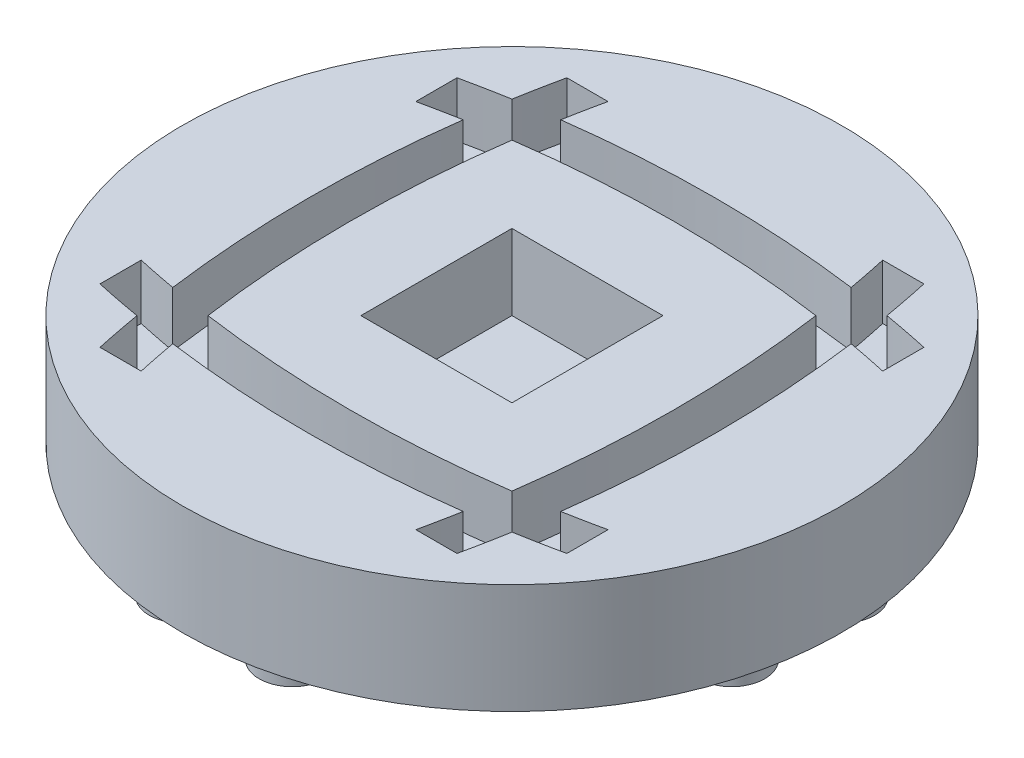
from build123d import *

# Parameters (mm, degrees)
SKETCH1_R           = 24
BOSS_EXTRUDE1_DEPTH = 8
SKETCH3_W           = 11
SKETCH3_H           = 11
CUT_EXTRUDE2_DEPTH  = 5.5
CUT_EXTRUDE6_DEPTH  = 4
SKETCH11_R          = 2.41
BOSS_EXTRUDE2_DEPTH = 1.7


with BuildPart() as part:
    # Sketch1 → Boss-Extrude1 (new body)
    with BuildSketch(Plane(origin=(0, 0, 0), x_dir=(1, 0, 0), z_dir=(0, 1, 0))):
        with Locations(Location((0, 0, 0), (0, 0, 270))):
            Circle(SKETCH1_R)
    extrude(amount=BOSS_EXTRUDE1_DEPTH)

    # Sketch3 → Cut-Extrude2 (cut)
    with BuildSketch(Plane(origin=(0, 8, 0), x_dir=(1, 0, 0), z_dir=(0, 1, 0))):
        Rectangle(SKETCH3_W, SKETCH3_H)
    extrude(amount=-CUT_EXTRUDE2_DEPTH, mode=Mode.SUBTRACT)

    # Sketch10 → Cut-Extrude6 (cut)
    with BuildSketch(Plane(origin=(0, 8, 0), x_dir=(1, 0, 0), z_dir=(0, 1, 0))):
        with BuildLine():
            Line((-17, 13), (-17, 10))
            ThreePointArc((-17, 10), (-15.565150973, 10.301241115), (-14.124974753, 10.575887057))
            ThreePointArc((-14.124974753, 10.575887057), (-14.827114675, 0), (-14.124974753, -10.575887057))
            ThreePointArc((-14.124974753, -10.575887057), (-15.565150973, -10.301241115), (-17, -10))
            Line((-17, -10), (-17, -13))
            ThreePointArc((-17, -13), (-15.330185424, -13.344535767), (-13.653407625, -13.653407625))
            ThreePointArc((-13.653407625, -13.653407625), (-13.344535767, -15.330185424), (-13, -17))
            Line((-13, -17), (-10, -17))
            ThreePointArc((-10, -17), (-10.301241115, -15.565150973), (-10.575887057, -14.124974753))
            ThreePointArc((-10.575887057, -14.124974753), (0, -14.827114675), (10.575887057, -14.124974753))
            ThreePointArc((10.575887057, -14.124974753), (10.301241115, -15.565150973), (10, -17))
            Line((10, -17), (13, -17))
            ThreePointArc((13, -17), (13.344535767, -15.330185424), (13.653407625, -13.653407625))
            ThreePointArc((13.653407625, -13.653407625), (15.330185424, -13.344535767), (17, -13))
            Line((17, -13), (17, -10))
            ThreePointArc((17, -10), (15.565150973, -10.301241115), (14.124974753, -10.575887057))
            ThreePointArc((14.124974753, -10.575887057), (14.827114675, 0), (14.124974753, 10.575887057))
            ThreePointArc((14.124974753, 10.575887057), (15.565150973, 10.301241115), (17, 10))
            Line((17, 10), (17, 13))
            ThreePointArc((17, 13), (15.330185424, 13.344535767), (13.653407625, 13.653407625))
            ThreePointArc((13.653407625, 13.653407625), (13.344535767, 15.330185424), (13, 17))
            Line((13, 17), (10, 17))
            ThreePointArc((10, 17), (10.301241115, 15.565150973), (10.575887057, 14.124974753))
            ThreePointArc((10.575887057, 14.124974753), (0, 14.827114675), (-10.575887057, 14.124974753))
            ThreePointArc((-10.575887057, 14.124974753), (-10.301241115, 15.565150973), (-10, 17))
            Line((-10, 17), (-13, 17))
            ThreePointArc((-13, 17), (-13.344535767, 15.330185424), (-13.653407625, 13.653407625))
            ThreePointArc((-13.653407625, 13.653407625), (-15.330185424, 13.344535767), (-17, 13))
        make_face()
        with BuildLine():
            ThreePointArc((-11.068117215, 11.068117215), (0, 11.844812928), (11.068117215, 11.068117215))
            ThreePointArc((11.068117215, 11.068117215), (11.844812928, 0), (11.068117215, -11.068117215))
            ThreePointArc((11.068117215, -11.068117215), (0, -11.844812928), (-11.068117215, -11.068117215))
            ThreePointArc((-11.068117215, -11.068117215), (-11.844812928, 0), (-11.068117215, 11.068117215))
        make_face(mode=Mode.SUBTRACT)
    extrude(amount=-CUT_EXTRUDE6_DEPTH, mode=Mode.SUBTRACT)

    # Sketch11 → Boss-Extrude2 (add)
    with BuildSketch(Plane.XZ):
        with Locations(Location((-4, -20, 0), (0, 0, 90))):
            Circle(SKETCH11_R)
        with Locations(Location((4, -20, 0), (0, 0, 90))):
            Circle(SKETCH11_R)
        with Locations(Location((-12, -12, 0), (0, 0, 90))):
            Circle(SKETCH11_R)
        with Locations(Location((-4, -12, 0), (0, 0, 90))):
            Circle(SKETCH11_R)
        with Locations(Location((4, -12, 0), (0, 0, 90))):
            Circle(SKETCH11_R)
        with Locations(Location((12, -12, 0), (0, 0, 90))):
            Circle(SKETCH11_R)
        with Locations(Location((-12, -4, 0), (0, 0, 90))):
            Circle(SKETCH11_R)
        with Locations(Location((-4, -4, 0), (0, 0, 90))):
            Circle(SKETCH11_R)
        with Locations(Location((4, -4, 0), (0, 0, 90))):
            Circle(SKETCH11_R)
        with Locations(Location((12, -4, 0), (0, 0, 90))):
            Circle(SKETCH11_R)
        with Locations(Location((20, -4, 0), (0, 0, 90))):
            Circle(SKETCH11_R)
        with Locations(Location((-12, 4, 0), (0, 0, 90))):
            Circle(SKETCH11_R)
        with Locations(Location((-4, 4, 0), (0, 0, 90))):
            Circle(SKETCH11_R)
        with Locations(Location((4, 4, 0), (0, 0, 90))):
            Circle(SKETCH11_R)
        with Locations(Location((12, 4, 0), (0, 0, 90))):
            Circle(SKETCH11_R)
        with Locations(Location((20, 4, 0), (0, 0, 90))):
            Circle(SKETCH11_R)
        with Locations(Location((-12, 12, 0), (0, 0, 90))):
            Circle(SKETCH11_R)
        with Locations(Location((-4, 12, 0), (0, 0, 90))):
            Circle(SKETCH11_R)
        with Locations(Location((4, 12, 0), (0, 0, 90))):
            Circle(SKETCH11_R)
        with Locations(Location((12, 12, 0), (0, 0, 90))):
            Circle(SKETCH11_R)
        with Locations(Location((-4, 20, 0), (0, 0, 90))):
            Circle(SKETCH11_R)
        with Locations(Location((4, 20, 0), (0, 0, 90))):
            Circle(SKETCH11_R)
        with Locations(Location((-20, -4, 0), (0, 0, 90))):
            Circle(SKETCH11_R)
        with Locations(Location((-20, 4, 0), (0, 0, 90))):
            Circle(SKETCH11_R)
    extrude(amount=BOSS_EXTRUDE2_DEPTH)


solid = part.part
